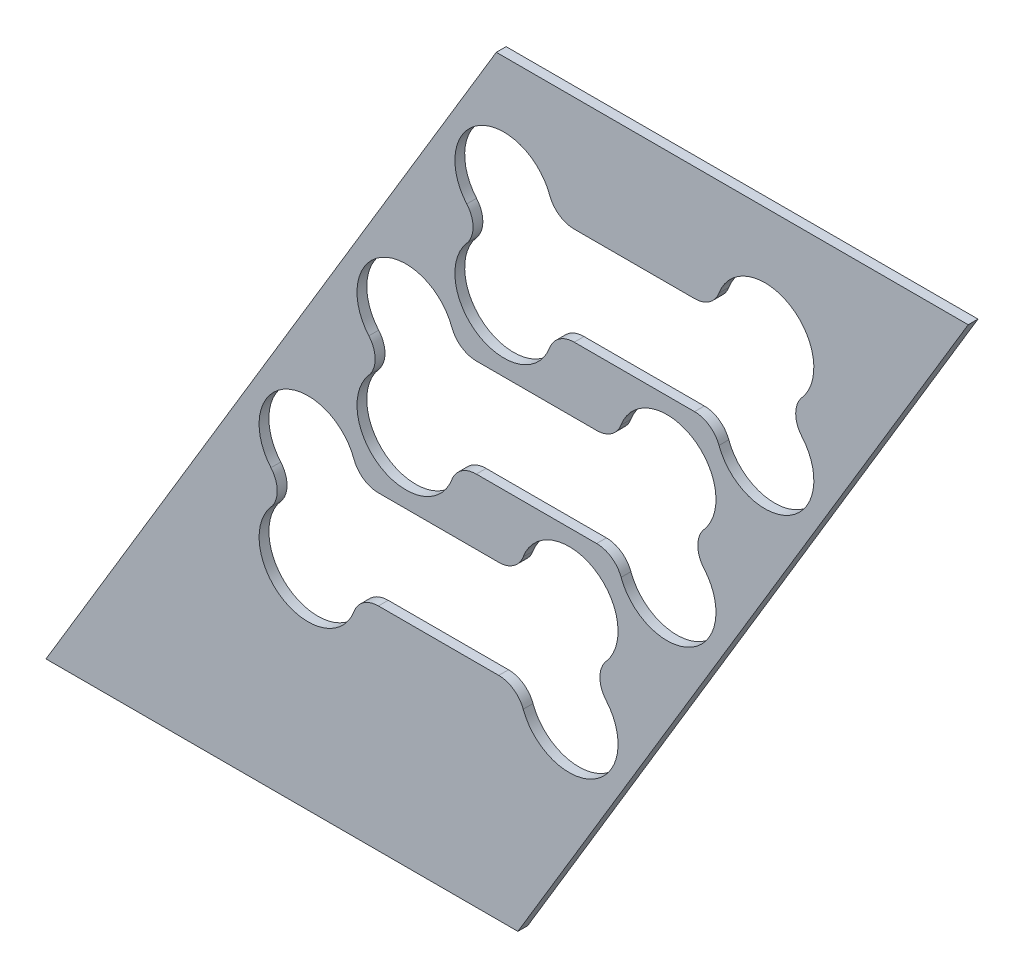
from build123d import *

# Parameters (mm, degrees)
FEUILLARD_DEPTH = 1.5
D_COUPE_DEPTH   = 111.511905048


with BuildPart() as part:
    # Esquisse1 → Feuillard (new body)
    with BuildSketch(Plane.XY):
        Polygon((8.848098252, 75), (-60.151901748, -40), (12.151901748, -40), (81.151901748, 75), align=None)
    extrude(amount=FEUILLARD_DEPTH)

    # Esquisse2 → D_coupe (cut, through all)
    with BuildSketch(Plane.XY):
        with BuildLine():
            Line((9.218070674, 7.5), (-9.218070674, 7.5))
            ThreePointArc((-9.218070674, 7.5), (-11.502231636, 8.216311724), (-12.968306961, 10.108695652))
            ThreePointArc((-12.968306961, 10.108695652), (-23.809927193, 13.960220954), (-25.685520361, 2.608695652))
            ThreePointArc((-25.685520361, 2.608695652), (-24.717797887, 0), (-25.685520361, -2.608695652))
            ThreePointArc((-25.685520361, -2.608695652), (-23.809927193, -13.960220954), (-12.968306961, -10.108695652))
            ThreePointArc((-12.968306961, -10.108695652), (-11.502231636, -8.216311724), (-9.218070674, -7.5))
            Line((-9.218070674, -7.5), (9.218070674, -7.5))
            ThreePointArc((9.218070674, -7.5), (11.502231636, -8.216311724), (12.968306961, -10.108695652))
            ThreePointArc((12.968306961, -10.108695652), (23.809927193, -13.960220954), (25.685520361, -2.608695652))
            ThreePointArc((25.685520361, -2.608695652), (24.717797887, 0), (25.685520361, 2.608695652))
            ThreePointArc((25.685520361, 2.608695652), (23.809927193, 13.960220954), (12.968306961, 10.108695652))
            ThreePointArc((12.968306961, 10.108695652), (11.502231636, 8.216311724), (9.218070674, 7.5))
        make_face()
        with BuildLine():
            Line((24.218070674, 32.5), (5.781929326, 32.5))
            ThreePointArc((5.781929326, 32.5), (3.497768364, 33.216311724), (2.031693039, 35.108695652))
            ThreePointArc((2.031693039, 35.108695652), (-8.809927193, 38.960220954), (-10.685520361, 27.608695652))
            ThreePointArc((-10.685520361, 27.608695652), (-9.717797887, 25), (-10.685520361, 22.391304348))
            ThreePointArc((-10.685520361, 22.391304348), (-8.809927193, 11.039779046), (2.031693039, 14.891304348))
            ThreePointArc((2.031693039, 14.891304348), (3.497768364, 16.783688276), (5.781929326, 17.5))
            Line((5.781929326, 17.5), (24.218070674, 17.5))
            ThreePointArc((24.218070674, 17.5), (26.502231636, 16.783688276), (27.968306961, 14.891304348))
            ThreePointArc((27.968306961, 14.891304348), (38.809927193, 11.039779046), (40.685520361, 22.391304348))
            ThreePointArc((40.685520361, 22.391304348), (39.717797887, 25), (40.685520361, 27.608695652))
            ThreePointArc((40.685520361, 27.608695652), (38.809927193, 38.960220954), (27.968306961, 35.108695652))
            ThreePointArc((27.968306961, 35.108695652), (26.502231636, 33.216311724), (24.218070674, 32.5))
        make_face()
        with BuildLine():
            Line((39.218070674, 57.5), (20.781929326, 57.5))
            ThreePointArc((20.781929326, 57.5), (18.497768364, 58.216311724), (17.031693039, 60.108695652))
            ThreePointArc((17.031693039, 60.108695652), (6.190072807, 63.960220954), (4.314479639, 52.608695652))
            ThreePointArc((4.314479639, 52.608695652), (5.282202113, 50), (4.314479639, 47.391304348))
            ThreePointArc((4.314479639, 47.391304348), (6.190072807, 36.039779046), (17.031693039, 39.891304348))
            ThreePointArc((17.031693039, 39.891304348), (18.497768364, 41.783688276), (20.781929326, 42.5))
            Line((20.781929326, 42.5), (39.218070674, 42.5))
            ThreePointArc((39.218070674, 42.5), (41.502231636, 41.783688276), (42.968306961, 39.891304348))
            ThreePointArc((42.968306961, 39.891304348), (53.809927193, 36.039779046), (55.685520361, 47.391304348))
            ThreePointArc((55.685520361, 47.391304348), (54.717797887, 50), (55.685520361, 52.608695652))
            ThreePointArc((55.685520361, 52.608695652), (53.809927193, 63.960220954), (42.968306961, 60.108695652))
            ThreePointArc((42.968306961, 60.108695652), (41.502231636, 58.216311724), (39.218070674, 57.5))
        make_face()
    extrude(amount=D_COUPE_DEPTH, mode=Mode.SUBTRACT)


solid = part.part
